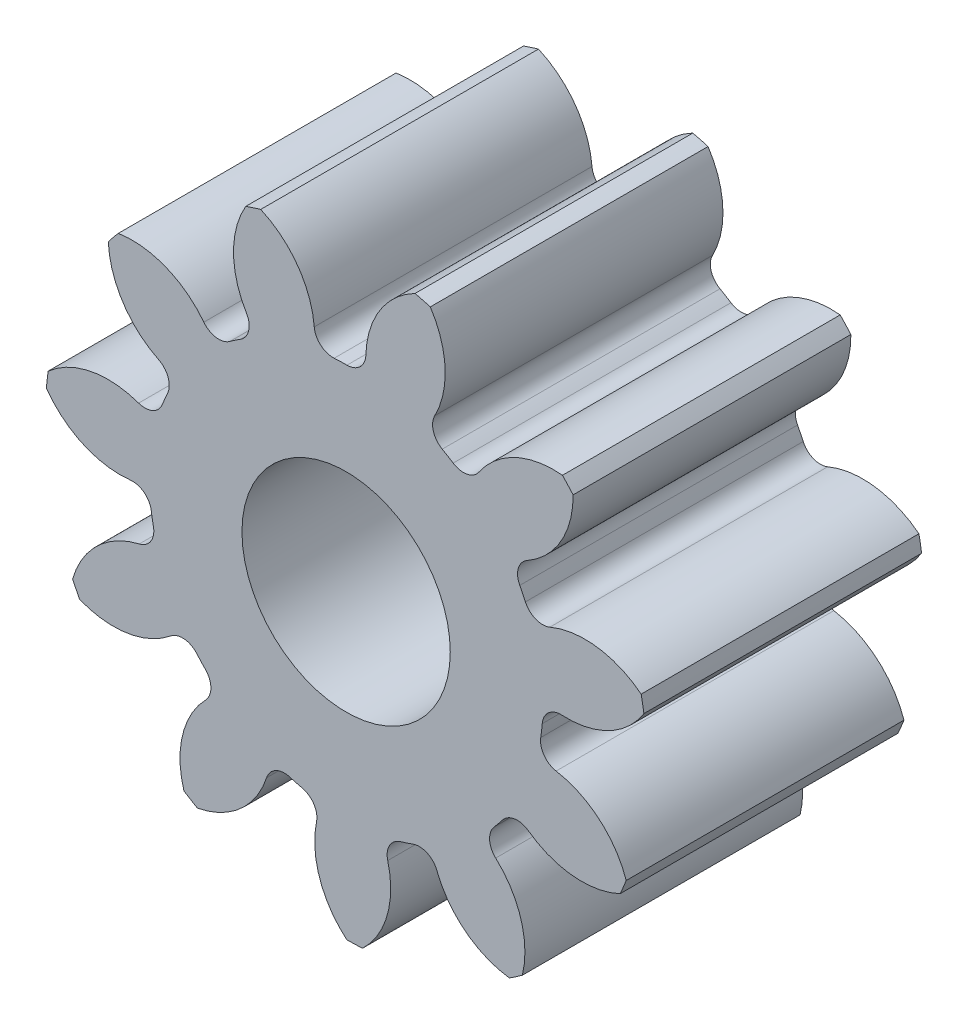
from build123d import *

# Parameters (mm, degrees)
SKETCH3_R         = 110.066666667
GEARBODY_DEPTH    = 101.6
TOOTHCUT_DEPTH    = 186.881419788
CIRPATTERN1_COUNT = 11
BOREDIA_R         = 38.1
BORE_DEPTH        = 12700


with BuildPart() as part:
    # Sketch3 → gearBody (new body)
    with BuildSketch(Plane.XY):
        Circle(SKETCH3_R)
    extrude(amount=GEARBODY_DEPTH)

    # Sketch2 → toothCut (cut, through all)
    with BuildSketch(Plane.XY):
        with BuildLine():
            ThreePointArc((71.190112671, -10.543669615), (71.495205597, -8.224152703), (71.724744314, -5.895944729))
            ThreePointArc((71.724744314, -5.895944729), (74.069205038, -1.261616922), (78.982930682, 0.42028397))
            ThreePointArc((78.982930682, 0.42028397), (97.073221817, 4.609449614), (110.066666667, 17.875124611))
            ThreePointArc((110.066666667, 17.875124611), (110.778199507, -12.742908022), (103.133205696, -42.399682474))
            ThreePointArc((103.133205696, -42.399682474), (93.491198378, -26.530232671), (76.824580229, -18.34295097))
            ThreePointArc((76.824580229, -18.34295097), (72.42108185, -15.589282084), (71.190112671, -10.543669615))
        make_face()
    toothcut = extrude(amount=TOOTHCUT_DEPTH, mode=Mode.SUBTRACT)

    # CirPattern1: toothCut ×11 about axis
    cirpattern1_axis = Axis((0, 0, 0), (0, 0, 1))
    for i in range(1, CIRPATTERN1_COUNT):
        add(toothcut.rotate(cirpattern1_axis, i * 360 / CIRPATTERN1_COUNT), mode=Mode.SUBTRACT)

    # boreDia → bore (cut, symmetric)
    with BuildSketch(Plane.XY):
        Circle(BOREDIA_R)
    extrude(amount=BORE_DEPTH, both=True, mode=Mode.SUBTRACT)


solid = part.part
